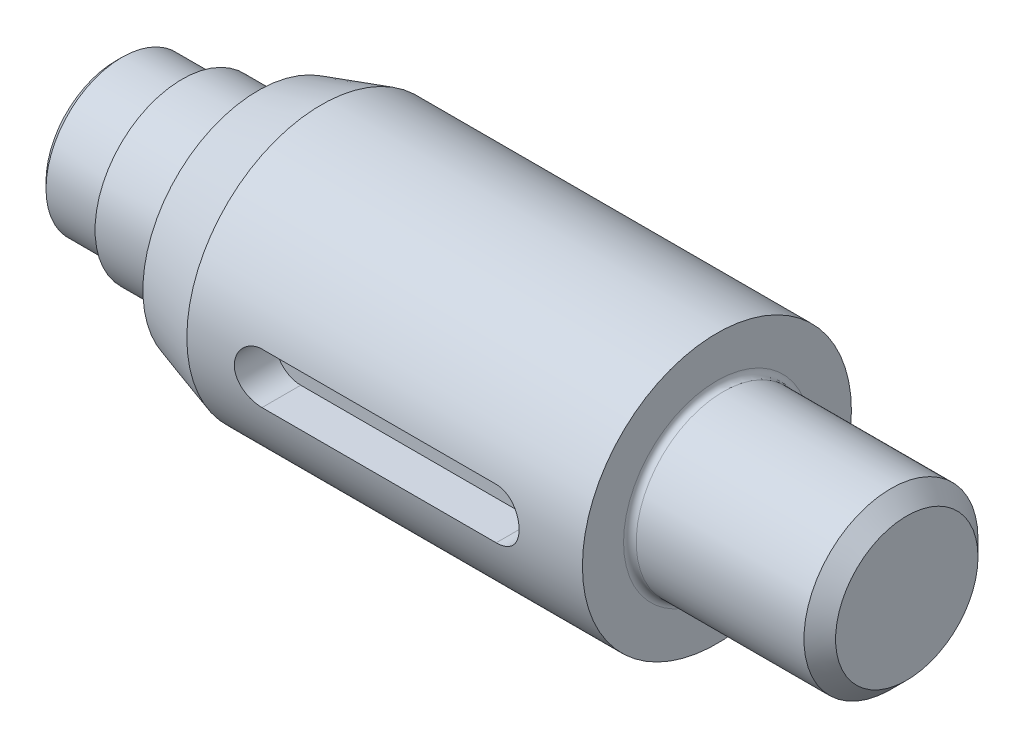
from build123d import *

# Parameters (mm, degrees)
WYTNIJ_WYCI_GNI_CIE1_START = 72
WYTNIJ_WYCI_GNI_CIE1_DEPTH = 196.453266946
SFAZOWANIE1_SIZE           = 2
SFAZOWANIE2_SIZE           = 5
ZAOKR_GLENIE1_R            = 2
ZAOKR_GLENIE2_R            = 3


with BuildPart() as part:
    # Szkic1 → Obr_t1 (revolve)
    with BuildSketch(Plane.XY, mode=Mode.PRIVATE) as obr_t1_sk:
        Polygon((0, 0), (0, 24), (19, 24), (19, 20), (21, 20), (21, 27.5), (45, 27.5), (45, 36.385386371), (65, 42.5), (190, 42.5), (190, 27.5), (250, 27.5), (250, 0), align=None)
    revolve(obr_t1_sk.sketch.rotate(Axis((0, 0, 0), (-1, 0, 0)), 90), axis=Axis((0, 0, 0), (-1, 0, 0)))

    # Szkic2 → Wytnij-wyci_gni_cie1 (cut, through all)
    with BuildSketch(Plane.XY.offset(-42.5).offset(WYTNIJ_WYCI_GNI_CIE1_START)):
        with BuildLine():
            Line((88, 8), (162, 8))
            ThreePointArc((162, 8), (170, 0), (162, -8))
            Line((162, -8), (88, -8))
            ThreePointArc((88, -8), (80, 0), (88, 8))
        make_face()
    extrude(amount=WYTNIJ_WYCI_GNI_CIE1_DEPTH, mode=Mode.SUBTRACT)

    # Sfazowanie1
    sfazowanie1_edges = [part.edges().sort_by_distance(p)[0] for p in [
        (0, 0, 24),
    ]]
    chamfer(sfazowanie1_edges, length=SFAZOWANIE1_SIZE)

    # Sfazowanie2
    sfazowanie2_edges = [part.edges().sort_by_distance(p)[0] for p in [
        (250, 0, 27.5),
    ]]
    chamfer(sfazowanie2_edges, length=SFAZOWANIE2_SIZE)

    # Zaokr_glenie1
    zaokr_glenie1_edges = [part.edges().sort_by_distance(p)[0] for p in [
        (190, 0, 27.5),
    ]]
    fillet(zaokr_glenie1_edges, radius=ZAOKR_GLENIE1_R)

    # Zaokr_glenie2
    zaokr_glenie2_edges = [part.edges().sort_by_distance(p)[0] for p in [
        (45, 0, 27.5),
    ]]
    fillet(zaokr_glenie2_edges, radius=ZAOKR_GLENIE2_R)


solid = part.part
